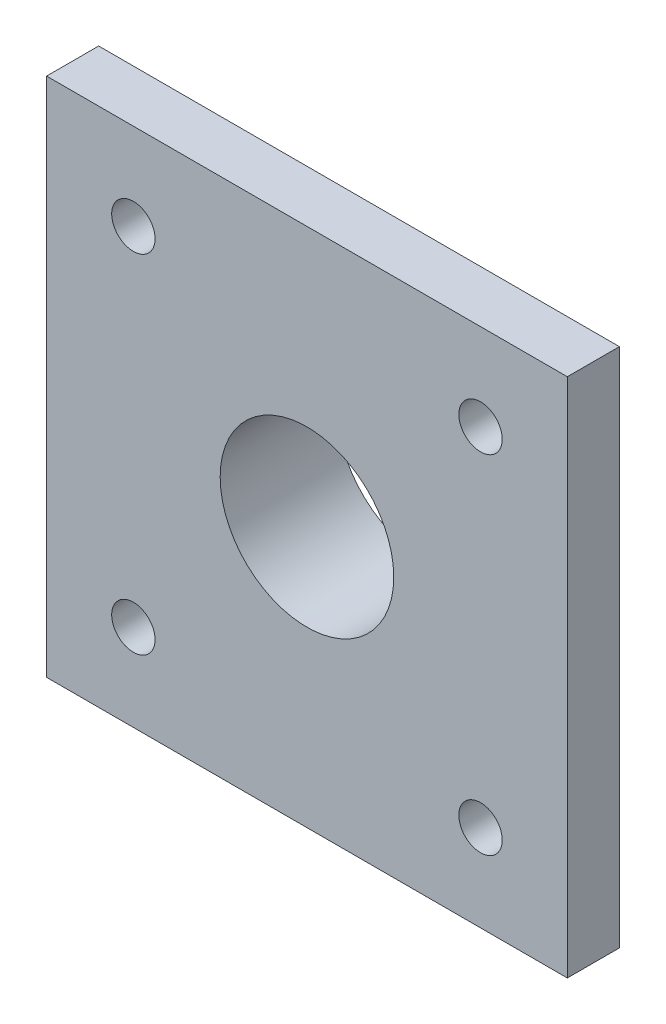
ISO-10303-21;
HEADER;
FILE_DESCRIPTION(('STEP AP214'),'2;1');
FILE_NAME('part.step','',(''),(''),'','','');
FILE_SCHEMA(('AUTOMOTIVE_DESIGN { 1 0 10303 214 1 1 1 1 }'));
ENDSEC;
DATA;
#1=APPLICATION_CONTEXT('core data for automotive mechanical design processes');
#2=APPLICATION_PROTOCOL_DEFINITION('international standard','automotive_design',2000,#1);
#3=PRODUCT_CONTEXT('',#1,'mechanical');
#4=PRODUCT('Part','Part','',(#3));
#5=PRODUCT_RELATED_PRODUCT_CATEGORY('part','',(#4));
#6=PRODUCT_DEFINITION_FORMATION('','',#4);
#7=PRODUCT_DEFINITION_CONTEXT('part definition',#1,'design');
#8=PRODUCT_DEFINITION('design','',#6,#7);
#9=PRODUCT_DEFINITION_SHAPE('','',#8);
#10=(LENGTH_UNIT() NAMED_UNIT(*) SI_UNIT(.MILLI.,.METRE.));
#11=(NAMED_UNIT(*) PLANE_ANGLE_UNIT() SI_UNIT($,.RADIAN.));
#12=(NAMED_UNIT(*) SI_UNIT($,.STERADIAN.) SOLID_ANGLE_UNIT());
#13=UNCERTAINTY_MEASURE_WITH_UNIT(LENGTH_MEASURE(1.E-05),#10,'distance_accuracy_value','');
#14=(GEOMETRIC_REPRESENTATION_CONTEXT(3) GLOBAL_UNCERTAINTY_ASSIGNED_CONTEXT((#13)) GLOBAL_UNIT_ASSIGNED_CONTEXT((#10,
#11,#12)) REPRESENTATION_CONTEXT('',''));
#15=CARTESIAN_POINT('',(0.,0.,0.));
#16=DIRECTION('',(0.,0.,1.));
#17=DIRECTION('',(1.,0.,0.));
#18=AXIS2_PLACEMENT_3D('',#15,#16,#17);
#19=CARTESIAN_POINT('',(60.,-60.,-12.));
#20=DIRECTION('',(1.,0.,0.));
#21=DIRECTION('',(0.,0.,-1.));
#22=AXIS2_PLACEMENT_3D('',#19,#20,#21);
#23=PLANE('',#22);
#24=DIRECTION('',(0.,1.,0.));
#25=VECTOR('',#24,1.);
#26=CARTESIAN_POINT('',(60.,-60.,0.));
#27=LINE('',#26,#25);
#28=CARTESIAN_POINT('',(60.,-60.,0.));
#29=VERTEX_POINT('',#28);
#30=CARTESIAN_POINT('',(60.,60.,0.));
#31=VERTEX_POINT('',#30);
#32=EDGE_CURVE('E104',#29,#31,#27,.T.);
#33=ORIENTED_EDGE('',*,*,#32,.F.);
#34=DIRECTION('',(0.,0.,1.));
#35=VECTOR('',#34,1.);
#36=CARTESIAN_POINT('',(60.,-60.,-12.));
#37=LINE('',#36,#35);
#38=CARTESIAN_POINT('',(60.,-60.,-12.));
#39=VERTEX_POINT('',#38);
#40=EDGE_CURVE('E48',#39,#29,#37,.T.);
#41=ORIENTED_EDGE('',*,*,#40,.F.);
#42=DIRECTION('',(0.,1.,0.));
#43=VECTOR('',#42,1.);
#44=CARTESIAN_POINT('',(60.,-60.,-12.));
#45=LINE('',#44,#43);
#46=CARTESIAN_POINT('',(60.,60.,-12.));
#47=VERTEX_POINT('',#46);
#48=EDGE_CURVE('E97',#39,#47,#45,.T.);
#49=ORIENTED_EDGE('',*,*,#48,.T.);
#50=DIRECTION('',(0.,0.,1.));
#51=VECTOR('',#50,1.);
#52=CARTESIAN_POINT('',(60.,60.,-12.));
#53=LINE('',#52,#51);
#54=EDGE_CURVE('E45',#47,#31,#53,.T.);
#55=ORIENTED_EDGE('',*,*,#54,.T.);
#56=EDGE_LOOP('',(#33,#41,#49,#55));
#57=FACE_BOUND('',#56,.T.);
#58=ADVANCED_FACE('F39',(#57),#23,.T.);
#59=CARTESIAN_POINT('',(-60.,-60.,-12.));
#60=DIRECTION('',(0.,-1.,0.));
#61=DIRECTION('',(0.,0.,-1.));
#62=AXIS2_PLACEMENT_3D('',#59,#60,#61);
#63=PLANE('',#62);
#64=DIRECTION('',(1.,0.,0.));
#65=VECTOR('',#64,1.);
#66=CARTESIAN_POINT('',(-60.,-60.,0.));
#67=LINE('',#66,#65);
#68=CARTESIAN_POINT('',(-60.,-60.,0.));
#69=VERTEX_POINT('',#68);
#70=EDGE_CURVE('E101',#69,#29,#67,.T.);
#71=ORIENTED_EDGE('',*,*,#70,.F.);
#72=DIRECTION('',(0.,0.,1.));
#73=VECTOR('',#72,1.);
#74=CARTESIAN_POINT('',(-60.,-60.,-12.));
#75=LINE('',#74,#73);
#76=CARTESIAN_POINT('',(-60.,-60.,-12.));
#77=VERTEX_POINT('',#76);
#78=EDGE_CURVE('E71',#77,#69,#75,.T.);
#79=ORIENTED_EDGE('',*,*,#78,.F.);
#80=DIRECTION('',(1.,0.,0.));
#81=VECTOR('',#80,1.);
#82=CARTESIAN_POINT('',(-60.,-60.,-12.));
#83=LINE('',#82,#81);
#84=EDGE_CURVE('E96',#77,#39,#83,.T.);
#85=ORIENTED_EDGE('',*,*,#84,.T.);
#86=ORIENTED_EDGE('',*,*,#40,.T.);
#87=EDGE_LOOP('',(#71,#79,#85,#86));
#88=FACE_BOUND('',#87,.T.);
#89=ADVANCED_FACE('F117',(#88),#63,.T.);
#90=CARTESIAN_POINT('',(-60.,-60.,-12.));
#91=DIRECTION('',(-1.,0.,0.));
#92=DIRECTION('',(0.,0.,1.));
#93=AXIS2_PLACEMENT_3D('',#90,#91,#92);
#94=PLANE('',#93);
#95=DIRECTION('',(0.,-1.,0.));
#96=VECTOR('',#95,1.);
#97=CARTESIAN_POINT('',(-60.,-60.,0.));
#98=LINE('',#97,#96);
#99=CARTESIAN_POINT('',(-60.,60.,0.));
#100=VERTEX_POINT('',#99);
#101=EDGE_CURVE('E93',#100,#69,#98,.T.);
#102=ORIENTED_EDGE('',*,*,#101,.F.);
#103=DIRECTION('',(0.,0.,1.));
#104=VECTOR('',#103,1.);
#105=CARTESIAN_POINT('',(-60.,60.,-12.));
#106=LINE('',#105,#104);
#107=CARTESIAN_POINT('',(-60.,60.,-12.));
#108=VERTEX_POINT('',#107);
#109=EDGE_CURVE('E88',#108,#100,#106,.T.);
#110=ORIENTED_EDGE('',*,*,#109,.F.);
#111=DIRECTION('',(0.,-1.,0.));
#112=VECTOR('',#111,1.);
#113=CARTESIAN_POINT('',(-60.,-60.,-12.));
#114=LINE('',#113,#112);
#115=EDGE_CURVE('E90',#108,#77,#114,.T.);
#116=ORIENTED_EDGE('',*,*,#115,.T.);
#117=ORIENTED_EDGE('',*,*,#78,.T.);
#118=EDGE_LOOP('',(#102,#110,#116,#117));
#119=FACE_BOUND('',#118,.T.);
#120=ADVANCED_FACE('F86',(#119),#94,.T.);
#121=CARTESIAN_POINT('',(-60.,60.,-12.));
#122=DIRECTION('',(0.,1.,0.));
#123=DIRECTION('',(0.,0.,1.));
#124=AXIS2_PLACEMENT_3D('',#121,#122,#123);
#125=PLANE('',#124);
#126=DIRECTION('',(-1.,0.,0.));
#127=VECTOR('',#126,1.);
#128=CARTESIAN_POINT('',(-60.,60.,0.));
#129=LINE('',#128,#127);
#130=EDGE_CURVE('E107',#31,#100,#129,.T.);
#131=ORIENTED_EDGE('',*,*,#130,.F.);
#132=ORIENTED_EDGE('',*,*,#54,.F.);
#133=DIRECTION('',(-1.,0.,0.));
#134=VECTOR('',#133,1.);
#135=CARTESIAN_POINT('',(-60.,60.,-12.));
#136=LINE('',#135,#134);
#137=EDGE_CURVE('E92',#47,#108,#136,.T.);
#138=ORIENTED_EDGE('',*,*,#137,.T.);
#139=ORIENTED_EDGE('',*,*,#109,.T.);
#140=EDGE_LOOP('',(#131,#132,#138,#139));
#141=FACE_BOUND('',#140,.T.);
#142=ADVANCED_FACE('F98',(#141),#125,.T.);
#143=CARTESIAN_POINT('',(0.,0.,-12.));
#144=DIRECTION('',(0.,0.,-1.));
#145=DIRECTION('',(-1.,0.,0.));
#146=AXIS2_PLACEMENT_3D('',#143,#144,#145);
#147=PLANE('',#146);
#148=CARTESIAN_POINT('',(40.,-40.,-12.));
#149=DIRECTION('',(0.,0.,1.));
#150=DIRECTION('',(1.,0.,0.));
#151=AXIS2_PLACEMENT_3D('',#148,#149,#150);
#152=CIRCLE('',#151,5.);
#153=CARTESIAN_POINT('',(45.,-40.,-12.));
#154=VERTEX_POINT('',#153);
#155=EDGE_CURVE('E168',#154,#154,#152,.T.);
#156=ORIENTED_EDGE('',*,*,#155,.T.);
#157=EDGE_LOOP('',(#156));
#158=FACE_BOUND('',#157,.T.);
#159=CARTESIAN_POINT('',(-40.,-40.,-12.));
#160=DIRECTION('',(0.,0.,1.));
#161=DIRECTION('',(1.,0.,0.));
#162=AXIS2_PLACEMENT_3D('',#159,#160,#161);
#163=CIRCLE('',#162,5.);
#164=CARTESIAN_POINT('',(-35.,-40.,-12.));
#165=VERTEX_POINT('',#164);
#166=EDGE_CURVE('E179',#165,#165,#163,.T.);
#167=ORIENTED_EDGE('',*,*,#166,.T.);
#168=EDGE_LOOP('',(#167));
#169=FACE_BOUND('',#168,.T.);
#170=CARTESIAN_POINT('',(-40.,40.,-12.));
#171=DIRECTION('',(0.,0.,1.));
#172=DIRECTION('',(1.,0.,0.));
#173=AXIS2_PLACEMENT_3D('',#170,#171,#172);
#174=CIRCLE('',#173,5.);
#175=CARTESIAN_POINT('',(-35.,40.,-12.));
#176=VERTEX_POINT('',#175);
#177=EDGE_CURVE('E184',#176,#176,#174,.T.);
#178=ORIENTED_EDGE('',*,*,#177,.T.);
#179=EDGE_LOOP('',(#178));
#180=FACE_BOUND('',#179,.T.);
#181=CARTESIAN_POINT('',(40.,40.,-12.));
#182=DIRECTION('',(0.,0.,1.));
#183=DIRECTION('',(1.,0.,0.));
#184=AXIS2_PLACEMENT_3D('',#181,#182,#183);
#185=CIRCLE('',#184,5.);
#186=CARTESIAN_POINT('',(45.,40.,-12.));
#187=VERTEX_POINT('',#186);
#188=EDGE_CURVE('E190',#187,#187,#185,.T.);
#189=ORIENTED_EDGE('',*,*,#188,.T.);
#190=EDGE_LOOP('',(#189));
#191=FACE_BOUND('',#190,.T.);
#192=CARTESIAN_POINT('',(0.,0.,-12.));
#193=DIRECTION('',(0.,0.,-1.));
#194=DIRECTION('',(-1.,0.,0.));
#195=AXIS2_PLACEMENT_3D('',#192,#193,#194);
#196=CIRCLE('',#195,35.);
#197=CARTESIAN_POINT('',(-35.,0.,-12.));
#198=VERTEX_POINT('',#197);
#199=EDGE_CURVE('E11',#198,#198,#196,.T.);
#200=ORIENTED_EDGE('',*,*,#199,.F.);
#201=EDGE_LOOP('',(#200));
#202=FACE_BOUND('',#201,.T.);
#203=ORIENTED_EDGE('',*,*,#48,.F.);
#204=ORIENTED_EDGE('',*,*,#84,.F.);
#205=ORIENTED_EDGE('',*,*,#115,.F.);
#206=ORIENTED_EDGE('',*,*,#137,.F.);
#207=EDGE_LOOP('',(#203,#204,#205,#206));
#208=FACE_BOUND('',#207,.T.);
#209=ADVANCED_FACE('F94',(#158,#169,#180,#191,#202,#208),#147,.T.);
#210=CARTESIAN_POINT('',(0.,0.,0.));
#211=DIRECTION('',(0.,0.,-1.));
#212=DIRECTION('',(-1.,0.,0.));
#213=AXIS2_PLACEMENT_3D('',#210,#211,#212);
#214=PLANE('',#213);
#215=CARTESIAN_POINT('',(40.,-40.,0.));
#216=DIRECTION('',(0.,0.,1.));
#217=DIRECTION('',(1.,0.,0.));
#218=AXIS2_PLACEMENT_3D('',#215,#216,#217);
#219=CIRCLE('',#218,5.);
#220=CARTESIAN_POINT('',(45.,-40.,0.));
#221=VERTEX_POINT('',#220);
#222=EDGE_CURVE('E174',#221,#221,#219,.T.);
#223=ORIENTED_EDGE('',*,*,#222,.F.);
#224=EDGE_LOOP('',(#223));
#225=FACE_BOUND('',#224,.T.);
#226=CARTESIAN_POINT('',(-40.,-40.,0.));
#227=DIRECTION('',(0.,0.,1.));
#228=DIRECTION('',(1.,0.,0.));
#229=AXIS2_PLACEMENT_3D('',#226,#227,#228);
#230=CIRCLE('',#229,5.);
#231=CARTESIAN_POINT('',(-35.,-40.,0.));
#232=VERTEX_POINT('',#231);
#233=EDGE_CURVE('E175',#232,#232,#230,.T.);
#234=ORIENTED_EDGE('',*,*,#233,.F.);
#235=EDGE_LOOP('',(#234));
#236=FACE_BOUND('',#235,.T.);
#237=CARTESIAN_POINT('',(-40.,40.,0.));
#238=DIRECTION('',(0.,0.,1.));
#239=DIRECTION('',(1.,0.,0.));
#240=AXIS2_PLACEMENT_3D('',#237,#238,#239);
#241=CIRCLE('',#240,5.);
#242=CARTESIAN_POINT('',(-35.,40.,0.));
#243=VERTEX_POINT('',#242);
#244=EDGE_CURVE('E182',#243,#243,#241,.T.);
#245=ORIENTED_EDGE('',*,*,#244,.F.);
#246=EDGE_LOOP('',(#245));
#247=FACE_BOUND('',#246,.T.);
#248=CARTESIAN_POINT('',(40.,40.,0.));
#249=DIRECTION('',(0.,0.,1.));
#250=DIRECTION('',(1.,0.,0.));
#251=AXIS2_PLACEMENT_3D('',#248,#249,#250);
#252=CIRCLE('',#251,5.);
#253=CARTESIAN_POINT('',(45.,40.,0.));
#254=VERTEX_POINT('',#253);
#255=EDGE_CURVE('E187',#254,#254,#252,.T.);
#256=ORIENTED_EDGE('',*,*,#255,.F.);
#257=EDGE_LOOP('',(#256));
#258=FACE_BOUND('',#257,.T.);
#259=CARTESIAN_POINT('',(0.,0.,0.));
#260=DIRECTION('',(0.,0.,1.));
#261=DIRECTION('',(1.,0.,0.));
#262=AXIS2_PLACEMENT_3D('',#259,#260,#261);
#263=CIRCLE('',#262,20.);
#264=CARTESIAN_POINT('',(20.,0.,0.));
#265=VERTEX_POINT('',#264);
#266=EDGE_CURVE('E194',#265,#265,#263,.T.);
#267=ORIENTED_EDGE('',*,*,#266,.F.);
#268=EDGE_LOOP('',(#267));
#269=FACE_BOUND('',#268,.T.);
#270=ORIENTED_EDGE('',*,*,#32,.T.);
#271=ORIENTED_EDGE('',*,*,#130,.T.);
#272=ORIENTED_EDGE('',*,*,#101,.T.);
#273=ORIENTED_EDGE('',*,*,#70,.T.);
#274=EDGE_LOOP('',(#270,#271,#272,#273));
#275=FACE_BOUND('',#274,.T.);
#276=ADVANCED_FACE('F116',(#225,#236,#247,#258,#269,#275),#214,.F.);
#277=CARTESIAN_POINT('',(0.,0.,-27.));
#278=DIRECTION('',(0.,0.,1.));
#279=DIRECTION('',(1.,0.,0.));
#280=AXIS2_PLACEMENT_3D('',#277,#278,#279);
#281=CYLINDRICAL_SURFACE('',#280,35.);
#282=ORIENTED_EDGE('',*,*,#199,.T.);
#283=EDGE_LOOP('',(#282));
#284=FACE_BOUND('',#283,.T.);
#285=CARTESIAN_POINT('',(0.,0.,-27.));
#286=DIRECTION('',(0.,0.,1.));
#287=DIRECTION('',(1.,0.,0.));
#288=AXIS2_PLACEMENT_3D('',#285,#286,#287);
#289=CIRCLE('',#288,35.);
#290=CARTESIAN_POINT('',(35.,0.,-27.));
#291=VERTEX_POINT('',#290);
#292=EDGE_CURVE('E108',#291,#291,#289,.T.);
#293=ORIENTED_EDGE('',*,*,#292,.T.);
#294=EDGE_LOOP('',(#293));
#295=FACE_BOUND('',#294,.T.);
#296=ADVANCED_FACE('F137',(#284,#295),#281,.T.);
#297=CARTESIAN_POINT('',(0.,0.,-27.));
#298=DIRECTION('',(0.,0.,1.));
#299=DIRECTION('',(1.,0.,0.));
#300=AXIS2_PLACEMENT_3D('',#297,#298,#299);
#301=PLANE('',#300);
#302=CARTESIAN_POINT('',(0.,0.,-27.));
#303=DIRECTION('',(0.,0.,1.));
#304=DIRECTION('',(1.,0.,0.));
#305=AXIS2_PLACEMENT_3D('',#302,#303,#304);
#306=CIRCLE('',#305,20.);
#307=CARTESIAN_POINT('',(20.,0.,-27.));
#308=VERTEX_POINT('',#307);
#309=EDGE_CURVE('E198',#308,#308,#306,.T.);
#310=ORIENTED_EDGE('',*,*,#309,.T.);
#311=EDGE_LOOP('',(#310));
#312=FACE_BOUND('',#311,.T.);
#313=ORIENTED_EDGE('',*,*,#292,.F.);
#314=EDGE_LOOP('',(#313));
#315=FACE_BOUND('',#314,.T.);
#316=ADVANCED_FACE('F141',(#312,#315),#301,.F.);
#317=CARTESIAN_POINT('',(0.,0.,-27.));
#318=DIRECTION('',(0.,0.,1.));
#319=DIRECTION('',(1.,0.,0.));
#320=AXIS2_PLACEMENT_3D('',#317,#318,#319);
#321=CYLINDRICAL_SURFACE('',#320,20.);
#322=ORIENTED_EDGE('',*,*,#309,.F.);
#323=EDGE_LOOP('',(#322));
#324=FACE_BOUND('',#323,.T.);
#325=ORIENTED_EDGE('',*,*,#266,.T.);
#326=EDGE_LOOP('',(#325));
#327=FACE_BOUND('',#326,.T.);
#328=ADVANCED_FACE('F150',(#324,#327),#321,.F.);
#329=CARTESIAN_POINT('',(40.,40.,-12.));
#330=DIRECTION('',(0.,0.,1.));
#331=DIRECTION('',(1.,0.,0.));
#332=AXIS2_PLACEMENT_3D('',#329,#330,#331);
#333=CYLINDRICAL_SURFACE('',#332,5.);
#334=ORIENTED_EDGE('',*,*,#188,.F.);
#335=EDGE_LOOP('',(#334));
#336=FACE_BOUND('',#335,.T.);
#337=ORIENTED_EDGE('',*,*,#255,.T.);
#338=EDGE_LOOP('',(#337));
#339=FACE_BOUND('',#338,.T.);
#340=ADVANCED_FACE('F151',(#336,#339),#333,.F.);
#341=CARTESIAN_POINT('',(-40.,40.,-12.));
#342=DIRECTION('',(0.,0.,1.));
#343=DIRECTION('',(1.,0.,0.));
#344=AXIS2_PLACEMENT_3D('',#341,#342,#343);
#345=CYLINDRICAL_SURFACE('',#344,5.);
#346=ORIENTED_EDGE('',*,*,#177,.F.);
#347=EDGE_LOOP('',(#346));
#348=FACE_BOUND('',#347,.T.);
#349=ORIENTED_EDGE('',*,*,#244,.T.);
#350=EDGE_LOOP('',(#349));
#351=FACE_BOUND('',#350,.T.);
#352=ADVANCED_FACE('F154',(#348,#351),#345,.F.);
#353=CARTESIAN_POINT('',(-40.,-40.,-12.));
#354=DIRECTION('',(0.,0.,1.));
#355=DIRECTION('',(1.,0.,0.));
#356=AXIS2_PLACEMENT_3D('',#353,#354,#355);
#357=CYLINDRICAL_SURFACE('',#356,5.);
#358=ORIENTED_EDGE('',*,*,#166,.F.);
#359=EDGE_LOOP('',(#358));
#360=FACE_BOUND('',#359,.T.);
#361=ORIENTED_EDGE('',*,*,#233,.T.);
#362=EDGE_LOOP('',(#361));
#363=FACE_BOUND('',#362,.T.);
#364=ADVANCED_FACE('F157',(#360,#363),#357,.F.);
#365=CARTESIAN_POINT('',(40.,-40.,-12.));
#366=DIRECTION('',(0.,0.,1.));
#367=DIRECTION('',(1.,0.,0.));
#368=AXIS2_PLACEMENT_3D('',#365,#366,#367);
#369=CYLINDRICAL_SURFACE('',#368,5.);
#370=ORIENTED_EDGE('',*,*,#155,.F.);
#371=EDGE_LOOP('',(#370));
#372=FACE_BOUND('',#371,.T.);
#373=ORIENTED_EDGE('',*,*,#222,.T.);
#374=EDGE_LOOP('',(#373));
#375=FACE_BOUND('',#374,.T.);
#376=ADVANCED_FACE('F165',(#372,#375),#369,.F.);
#377=CLOSED_SHELL('',(#58,#89,#120,#142,#209,#276,#296,#316,#328,#340,#352,#364,#376));
#378=MANIFOLD_SOLID_BREP('B2',#377);
#379=ADVANCED_BREP_SHAPE_REPRESENTATION('',(#18,#378),#14);
#380=SHAPE_DEFINITION_REPRESENTATION(#9,#379);
ENDSEC;
END-ISO-10303-21;
